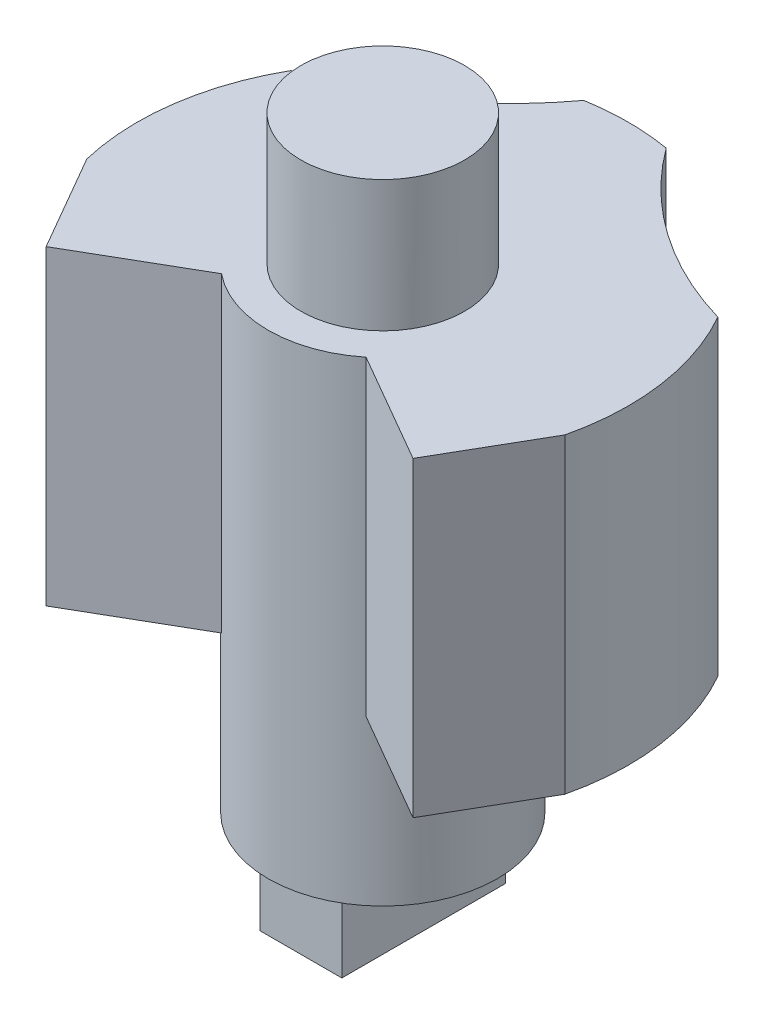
from build123d import *

# Parameters (mm, degrees)
BASE_EXTRUDE_DEPTH  = 12.065
SKETCH2_R           = 3.175
BOSS_EXTRUDE1_DEPTH = 5.08
BOSS_EXTRUDE2_START = 6.35
SKETCH3_R           = 4.445
BOSS_EXTRUDE2_DEPTH = 6.35
SKETCH5_W           = 3.175
SKETCH5_H           = 6.35
BOSS_EXTRUDE3_DEPTH = 3.175


with BuildPart() as part:
    # Sketch1 → Base-Extrude (new body)
    with BuildSketch(Plane(origin=(0, 0, 0), x_dir=(1, 0, 0), z_dir=(0, 1, 0))):
        with BuildLine():
            Line((2.80185865, -3.45074095), (7.111438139, -5.938877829))
            Line((7.111438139, -5.938877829), (9.265607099, -2.207747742))
            ThreePointArc((9.265607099, -2.207747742), (9.429198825, 1.347529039), (8.276322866, 4.71466911))
            ThreePointArc((8.276322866, 4.71466911), (4.552762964, 6.502019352), (1.59967064, 9.389711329))
            ThreePointArc((1.59967064, 9.389711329), (0.80269066, 9.491117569), (0, 9.525))
            Line((0, 9.525), (0, -4.445))
            ThreePointArc((0, -4.445), (1.486519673, -4.189067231), (2.80185865, -3.45074095))
        make_face()
    extrude(amount=BASE_EXTRUDE_DEPTH)

    # Boss-Mirror1: part across plane


with BuildPart() as part_1:
    add(part.part)
    add(part.part.mirror(Plane(origin=(0, 12.065, -9.525), x_dir=(0, 0, 1), z_dir=(1, 0, 0))))

    # Sketch2 → Boss-Extrude1 (add)
    with BuildSketch(Plane(origin=(0, 12.065, 0), x_dir=(-1, 0, 0), z_dir=(0, 1, 0))):
        with Locations(Location((0, 0, 0), (0, 0, 270))):
            Circle(SKETCH2_R)
    extrude(amount=BOSS_EXTRUDE1_DEPTH)

    # Sketch3 → Boss-Extrude2 (add)
    with BuildSketch(Plane.XZ.offset(BOSS_EXTRUDE2_START)):
        with Locations(Location((0, 0, 0), (0, 0, 270))):
            Circle(SKETCH3_R)
    extrude(amount=-BOSS_EXTRUDE2_DEPTH)

    # Sketch5 → Boss-Extrude3 (add)
    with BuildSketch(Plane.XZ.offset(6.35)):
        Rectangle(SKETCH5_W, SKETCH5_H)
    extrude(amount=BOSS_EXTRUDE3_DEPTH)


solid = part_1.part
